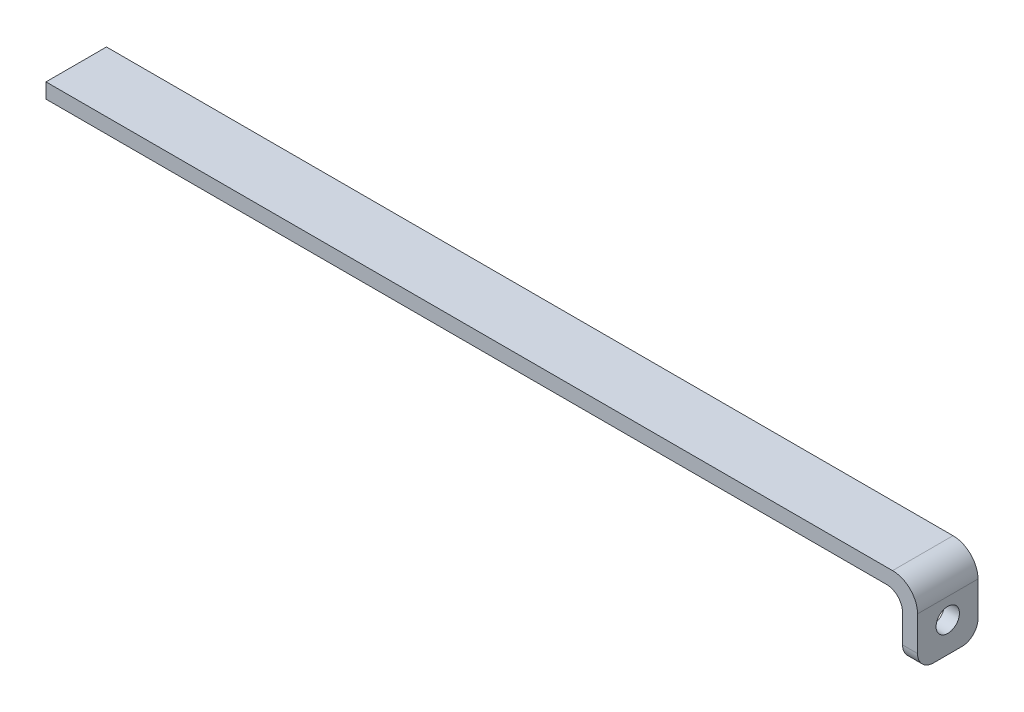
from build123d import *

# Parameters (mm, degrees)
SKETCH1_W           = 134.9248
SKETCH1_H           = 9.525
BOSS_EXTRUDE1_DEPTH = 2.3622
SKETCH2_W           = 9.525
SKETCH2_H           = 11.8872
BOSS_EXTRUDE2_DEPTH = 2.3622
SKETCH3_R           = 1.8415
CUT_EXTRUDE1_DEPTH  = 138.882947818
FILLET1_R           = 2.54
FILLET2_R           = 3.937


with BuildPart() as part:
    # Sketch1 → Boss-Extrude1 (new body)
    with BuildSketch(Plane(origin=(0, 0, 0), x_dir=(1, 0, 0), z_dir=(0, 1, 0))):
        with Locations((62.6999, 0)):
            Rectangle(SKETCH1_W, SKETCH1_H)
    extrude(amount=-BOSS_EXTRUDE1_DEPTH)

    # Sketch2 → Boss-Extrude2 (add)
    with BuildSketch(Plane(origin=(130.1623, 0, 0), x_dir=(0, 0, -1), z_dir=(1, 0, 0))):
        with Locations((0, -5.9436)):
            Rectangle(SKETCH2_W, SKETCH2_H)
    extrude(amount=BOSS_EXTRUDE2_DEPTH)

    # Sketch3 → Cut-Extrude1 (cut, through all)
    with BuildSketch(Plane(origin=(132.5245, 0, 0), x_dir=(0, 0, -1), z_dir=(1, 0, 0))):
        with Locations((0, -7.1374)):
            Circle(SKETCH3_R)
    extrude(amount=-CUT_EXTRUDE1_DEPTH, mode=Mode.SUBTRACT)

    # Fillet1
    fillet1_edges = [part.edges().sort_by_distance(p)[0] for p in [
        (130.1623, -2.3622, 0),
        (131.3434, -11.8872, 4.7625),
        (131.3434, -11.8872, -4.7625),
    ]]
    fillet(fillet1_edges, radius=FILLET1_R)

    # Fillet2
    fillet2_edges = [part.edges().sort_by_distance(p)[0] for p in [
        (132.5245, 0, 0),
    ]]
    fillet(fillet2_edges, radius=FILLET2_R)


solid = part.part
